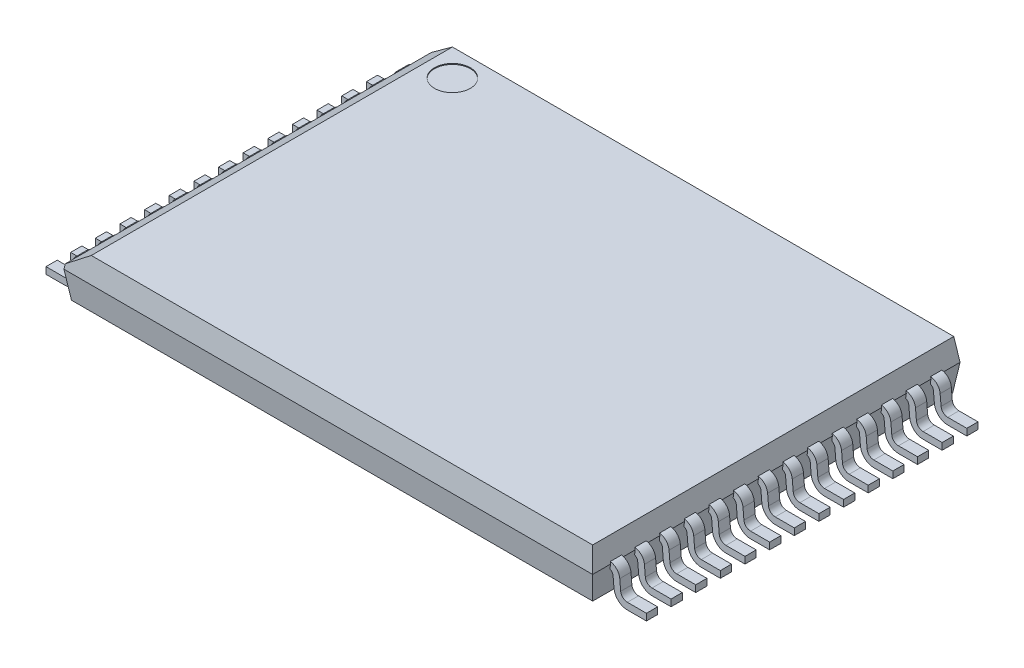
from build123d import *

# Parameters (mm, degrees)
EXTRUDE_1_DEPTH              = 0.125
SKETCH_8723_W                = 11.8
SKETCH_8723_H                = 8.2
EXTRUDE_8781_DEPTH           = 0.5
EXTRUDE_8781_TAPER           = 8
EXTRUDE_8781_OTHER_WAY_DEPTH = 0.6
EXTRUDE_8781_OTHER_WAY_TAPER = 8
PATTERN_LINEAR_8860_COUNT    = 14
PATTERN_LINEAR_8860_PITCH    = 0.55
CHAMFER_1_SIZE               = 0.4
CHAMFER_1_SIZE2              = 0.469982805
SKETCH_3_R                   = 0.4
CUT_EXTRUDE_3_DEPTH          = 0.02


with BuildPart() as part:
    # Sketch 1 → Extrude 1 (new, symmetric)
    with BuildSketch(Plane.XY.offset(-3.575)):
        with BuildLine():
            Line((-6.7, 0), (-6.274899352, 0))
            ThreePointArc((-6.274899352, 0), (-6.07222229, 0.078816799), (-5.976040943, 0.273853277))
            Line((-5.976040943, 0.273853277), (-5.955493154, 0.508715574))
            ThreePointArc((-5.955493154, 0.508715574), (-5.923432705, 0.573727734), (-5.855873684, 0.6))
            Line((-5.855873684, 0.6), (5.855873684, 0.6))
            ThreePointArc((5.855873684, 0.6), (5.923432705, 0.573727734), (5.955493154, 0.508715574))
            Line((5.955493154, 0.508715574), (5.976040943, 0.273853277))
            ThreePointArc((5.976040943, 0.273853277), (6.07222229, 0.078816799), (6.274899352, 0))
            Line((6.274899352, 0), (6.7, 0))
            Line((6.7, 0), (6.7, 0.15))
            Line((6.7, 0.15), (6.274899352, 0.15))
            ThreePointArc((6.274899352, 0.15), (6.173560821, 0.189408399), (6.125470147, 0.286926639))
            Line((6.125470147, 0.286926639), (6.104922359, 0.521788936))
            ThreePointArc((6.104922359, 0.521788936), (6.024771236, 0.684319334), (5.855873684, 0.75))
            Line((5.855873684, 0.75), (-5.855873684, 0.75))
            ThreePointArc((-5.855873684, 0.75), (-6.024771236, 0.684319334), (-6.104922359, 0.521788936))
            Line((-6.104922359, 0.521788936), (-6.125470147, 0.286926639))
            ThreePointArc((-6.125470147, 0.286926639), (-6.173560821, 0.189408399), (-6.274899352, 0.15))
            Line((-6.274899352, 0.15), (-6.7, 0.15))
            Line((-6.7, 0.15), (-6.7, 0))
        make_face()
    extrude_1 = extrude(amount=EXTRUDE_1_DEPTH, both=True)

    # Sketch 8723 → Extrude 8781 (add)
    with BuildSketch(Plane(origin=(0, 0.7, 0), x_dir=(1, 0, 0), z_dir=(0, 1, 0))):
        Rectangle(SKETCH_8723_W, SKETCH_8723_H)
    extrude(amount=EXTRUDE_8781_DEPTH, taper=EXTRUDE_8781_TAPER)

    # Sketch 8723 → Extrude 8781 other way (add)
    with BuildSketch(Plane(origin=(0, 0.7, 0), x_dir=(1, 0, 0), z_dir=(0, 1, 0))):
        Rectangle(SKETCH_8723_W, SKETCH_8723_H)
    extrude(amount=-EXTRUDE_8781_OTHER_WAY_DEPTH, taper=EXTRUDE_8781_OTHER_WAY_TAPER)

    # Pattern Linear 8860: Extrude 1 ×14
    with Locations(*[(0, 0, i * PATTERN_LINEAR_8860_PITCH) for i in range(1, PATTERN_LINEAR_8860_COUNT)]):
        add(extrude_1)

    # Chamfer 1
    chamfer_1_edges = [part.edges().sort_by_distance(p)[0] for p in [
        (-5.829729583, 1.2, 0),
    ]]
    chamfer_1_side = [part.faces().sort_by_distance(p)[0] for p in [
        (-5.863623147, 0.958834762, 0),
    ]]
    chamfer(chamfer_1_edges, length=CHAMFER_1_SIZE, length2=CHAMFER_1_SIZE2, reference=chamfer_1_side[0])

    # Sketch 3 → Cut-Extrude 3 (cut)
    with BuildSketch(Plane(origin=(0, 1.2, 0), x_dir=(1, 0, 0), z_dir=(0, 1, 0))):
        with Locations(Location((-4.759746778, 3.429729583, 0), (0, 0, 270))):
            Circle(SKETCH_3_R)
    extrude(amount=-CUT_EXTRUDE_3_DEPTH, mode=Mode.SUBTRACT)


solid = part.part
